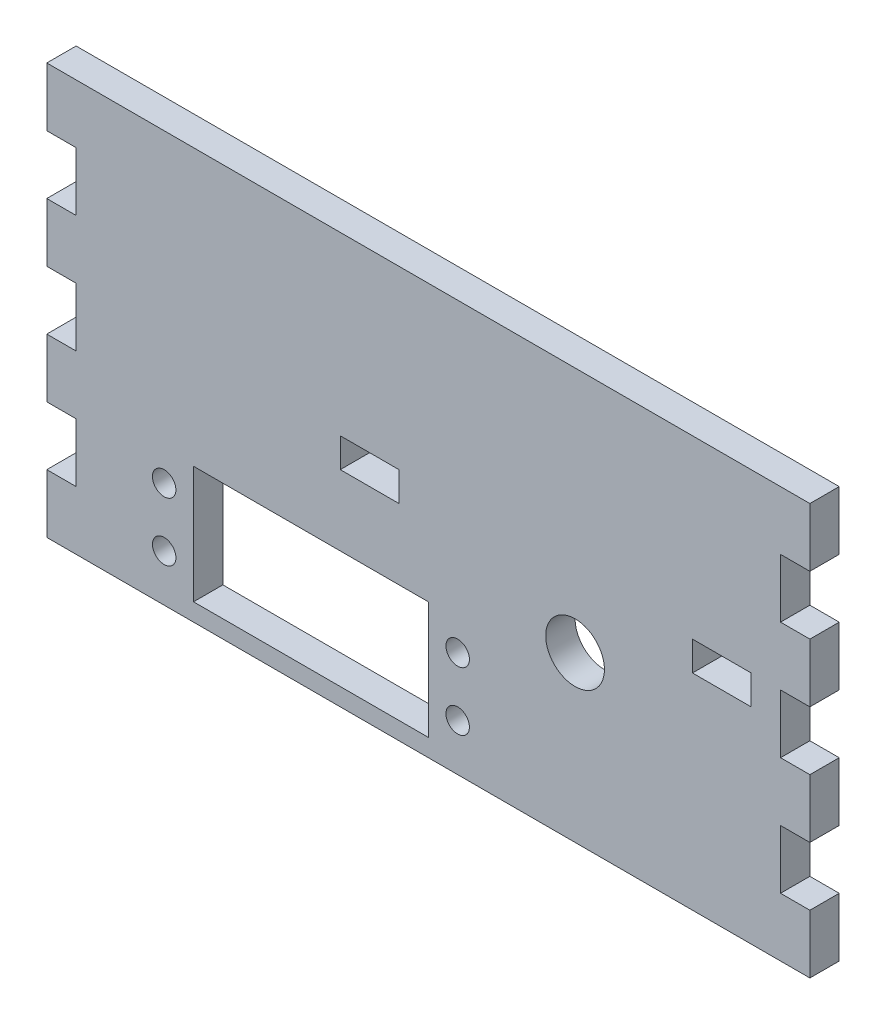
ISO-10303-21;
HEADER;
FILE_DESCRIPTION(('STEP AP214'),'2;1');
FILE_NAME('part.step','',(''),(''),'','','');
FILE_SCHEMA(('AUTOMOTIVE_DESIGN { 1 0 10303 214 1 1 1 1 }'));
ENDSEC;
DATA;
#1=APPLICATION_CONTEXT('core data for automotive mechanical design processes');
#2=APPLICATION_PROTOCOL_DEFINITION('international standard','automotive_design',2000,#1);
#3=PRODUCT_CONTEXT('',#1,'mechanical');
#4=PRODUCT('Part','Part','',(#3));
#5=PRODUCT_RELATED_PRODUCT_CATEGORY('part','',(#4));
#6=PRODUCT_DEFINITION_FORMATION('','',#4);
#7=PRODUCT_DEFINITION_CONTEXT('part definition',#1,'design');
#8=PRODUCT_DEFINITION('design','',#6,#7);
#9=PRODUCT_DEFINITION_SHAPE('','',#8);
#10=(LENGTH_UNIT() NAMED_UNIT(*) SI_UNIT(.MILLI.,.METRE.));
#11=(NAMED_UNIT(*) PLANE_ANGLE_UNIT() SI_UNIT($,.RADIAN.));
#12=(NAMED_UNIT(*) SI_UNIT($,.STERADIAN.) SOLID_ANGLE_UNIT());
#13=UNCERTAINTY_MEASURE_WITH_UNIT(LENGTH_MEASURE(1.E-05),#10,'distance_accuracy_value','');
#14=(GEOMETRIC_REPRESENTATION_CONTEXT(3) GLOBAL_UNCERTAINTY_ASSIGNED_CONTEXT((#13)) GLOBAL_UNIT_ASSIGNED_CONTEXT((#10,
#11,#12)) REPRESENTATION_CONTEXT('',''));
#15=CARTESIAN_POINT('',(0.,0.,0.));
#16=DIRECTION('',(0.,0.,1.));
#17=DIRECTION('',(1.,0.,0.));
#18=AXIS2_PLACEMENT_3D('',#15,#16,#17);
#19=CARTESIAN_POINT('',(-45.,35.,5.));
#20=DIRECTION('',(1.,0.,0.));
#21=DIRECTION('',(0.,1.,0.));
#22=AXIS2_PLACEMENT_3D('',#19,#20,#21);
#23=PLANE('',#22);
#24=DIRECTION('',(0.,0.,-1.));
#25=VECTOR('',#24,1.);
#26=CARTESIAN_POINT('',(-45.,-25.,0.));
#27=LINE('',#26,#25);
#28=CARTESIAN_POINT('',(-45.,-25.,5.));
#29=VERTEX_POINT('',#28);
#30=CARTESIAN_POINT('',(-45.,-25.,0.));
#31=VERTEX_POINT('',#30);
#32=EDGE_CURVE('E315',#29,#31,#27,.T.);
#33=ORIENTED_EDGE('',*,*,#32,.F.);
#34=DIRECTION('',(0.,-1.,0.));
#35=VECTOR('',#34,1.);
#36=CARTESIAN_POINT('',(-45.,35.,5.));
#37=LINE('',#36,#35);
#38=CARTESIAN_POINT('',(-45.,-15.,5.));
#39=VERTEX_POINT('',#38);
#40=EDGE_CURVE('E50',#39,#29,#37,.T.);
#41=ORIENTED_EDGE('',*,*,#40,.F.);
#42=DIRECTION('',(0.,0.,1.));
#43=VECTOR('',#42,1.);
#44=CARTESIAN_POINT('',(-45.,-15.,5.));
#45=LINE('',#44,#43);
#46=CARTESIAN_POINT('',(-45.,-15.,0.));
#47=VERTEX_POINT('',#46);
#48=EDGE_CURVE('E321',#47,#39,#45,.T.);
#49=ORIENTED_EDGE('',*,*,#48,.F.);
#50=DIRECTION('',(0.,-1.,0.));
#51=VECTOR('',#50,1.);
#52=CARTESIAN_POINT('',(-45.,35.,0.));
#53=LINE('',#52,#51);
#54=EDGE_CURVE('E412',#47,#31,#53,.T.);
#55=ORIENTED_EDGE('',*,*,#54,.T.);
#56=EDGE_LOOP('',(#33,#41,#49,#55));
#57=FACE_BOUND('',#56,.T.);
#58=ADVANCED_FACE('F33',(#57),#23,.F.);
#59=DIRECTION('',(0.,0.,-1.));
#60=VECTOR('',#59,1.);
#61=CARTESIAN_POINT('',(-45.,-5.00000000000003,0.));
#62=LINE('',#61,#60);
#63=CARTESIAN_POINT('',(-45.,-5.00000000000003,5.));
#64=VERTEX_POINT('',#63);
#65=CARTESIAN_POINT('',(-45.,-5.00000000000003,0.));
#66=VERTEX_POINT('',#65);
#67=EDGE_CURVE('E58',#64,#66,#62,.T.);
#68=ORIENTED_EDGE('',*,*,#67,.F.);
#69=CARTESIAN_POINT('',(-45.,4.99999999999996,5.));
#70=VERTEX_POINT('',#69);
#71=EDGE_CURVE('E413',#70,#64,#37,.T.);
#72=ORIENTED_EDGE('',*,*,#71,.F.);
#73=DIRECTION('',(0.,0.,1.));
#74=VECTOR('',#73,1.);
#75=CARTESIAN_POINT('',(-45.,4.99999999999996,5.));
#76=LINE('',#75,#74);
#77=CARTESIAN_POINT('',(-45.,4.99999999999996,0.));
#78=VERTEX_POINT('',#77);
#79=EDGE_CURVE('E353',#78,#70,#76,.T.);
#80=ORIENTED_EDGE('',*,*,#79,.F.);
#81=EDGE_CURVE('E408',#78,#66,#53,.T.);
#82=ORIENTED_EDGE('',*,*,#81,.T.);
#83=EDGE_LOOP('',(#68,#72,#80,#82));
#84=FACE_BOUND('',#83,.T.);
#85=ADVANCED_FACE('F652',(#84),#23,.F.);
#86=DIRECTION('',(0.,0.,-1.));
#87=VECTOR('',#86,1.);
#88=CARTESIAN_POINT('',(-45.,15.,0.));
#89=LINE('',#88,#87);
#90=CARTESIAN_POINT('',(-45.,15.,5.));
#91=VERTEX_POINT('',#90);
#92=CARTESIAN_POINT('',(-45.,15.,0.));
#93=VERTEX_POINT('',#92);
#94=EDGE_CURVE('E348',#91,#93,#89,.T.);
#95=ORIENTED_EDGE('',*,*,#94,.F.);
#96=CARTESIAN_POINT('',(-45.,25.,5.));
#97=VERTEX_POINT('',#96);
#98=EDGE_CURVE('E395',#97,#91,#37,.T.);
#99=ORIENTED_EDGE('',*,*,#98,.F.);
#100=DIRECTION('',(0.,0.,1.));
#101=VECTOR('',#100,1.);
#102=CARTESIAN_POINT('',(-45.,25.,5.));
#103=LINE('',#102,#101);
#104=CARTESIAN_POINT('',(-45.,25.,0.));
#105=VERTEX_POINT('',#104);
#106=EDGE_CURVE('E375',#105,#97,#103,.T.);
#107=ORIENTED_EDGE('',*,*,#106,.F.);
#108=EDGE_CURVE('E411',#105,#93,#53,.T.);
#109=ORIENTED_EDGE('',*,*,#108,.T.);
#110=EDGE_LOOP('',(#95,#99,#107,#109));
#111=FACE_BOUND('',#110,.T.);
#112=ADVANCED_FACE('F35',(#111),#23,.F.);
#113=CARTESIAN_POINT('',(75.,35.,5.));
#114=DIRECTION('',(-1.,0.,0.));
#115=DIRECTION('',(0.,-1.,0.));
#116=AXIS2_PLACEMENT_3D('',#113,#114,#115);
#117=PLANE('',#116);
#118=DIRECTION('',(0.,0.,-1.));
#119=VECTOR('',#118,1.);
#120=CARTESIAN_POINT('',(75.,25.,5.));
#121=LINE('',#120,#119);
#122=CARTESIAN_POINT('',(75.,25.,5.));
#123=VERTEX_POINT('',#122);
#124=CARTESIAN_POINT('',(75.,25.,0.));
#125=VERTEX_POINT('',#124);
#126=EDGE_CURVE('E405',#123,#125,#121,.T.);
#127=ORIENTED_EDGE('',*,*,#126,.F.);
#128=DIRECTION('',(0.,1.,0.));
#129=VECTOR('',#128,1.);
#130=CARTESIAN_POINT('',(75.,35.,5.));
#131=LINE('',#130,#129);
#132=CARTESIAN_POINT('',(75.,15.,5.));
#133=VERTEX_POINT('',#132);
#134=EDGE_CURVE('E437',#133,#123,#131,.T.);
#135=ORIENTED_EDGE('',*,*,#134,.F.);
#136=DIRECTION('',(0.,0.,1.));
#137=VECTOR('',#136,1.);
#138=CARTESIAN_POINT('',(75.,15.,5.));
#139=LINE('',#138,#137);
#140=CARTESIAN_POINT('',(75.,15.,0.));
#141=VERTEX_POINT('',#140);
#142=EDGE_CURVE('E888',#141,#133,#139,.T.);
#143=ORIENTED_EDGE('',*,*,#142,.F.);
#144=DIRECTION('',(0.,1.,0.));
#145=VECTOR('',#144,1.);
#146=CARTESIAN_POINT('',(75.,35.,0.));
#147=LINE('',#146,#145);
#148=EDGE_CURVE('E452',#141,#125,#147,.T.);
#149=ORIENTED_EDGE('',*,*,#148,.T.);
#150=EDGE_LOOP('',(#127,#135,#143,#149));
#151=FACE_BOUND('',#150,.T.);
#152=ADVANCED_FACE('F657',(#151),#117,.F.);
#153=DIRECTION('',(0.,0.,-1.));
#154=VECTOR('',#153,1.);
#155=CARTESIAN_POINT('',(75.,5.,5.));
#156=LINE('',#155,#154);
#157=CARTESIAN_POINT('',(75.,5.,5.));
#158=VERTEX_POINT('',#157);
#159=CARTESIAN_POINT('',(75.,5.,0.));
#160=VERTEX_POINT('',#159);
#161=EDGE_CURVE('E891',#158,#160,#156,.T.);
#162=ORIENTED_EDGE('',*,*,#161,.F.);
#163=CARTESIAN_POINT('',(75.,-5.,5.));
#164=VERTEX_POINT('',#163);
#165=EDGE_CURVE('E446',#164,#158,#131,.T.);
#166=ORIENTED_EDGE('',*,*,#165,.F.);
#167=DIRECTION('',(0.,0.,1.));
#168=VECTOR('',#167,1.);
#169=CARTESIAN_POINT('',(75.,-5.,5.));
#170=LINE('',#169,#168);
#171=CARTESIAN_POINT('',(75.,-5.,0.));
#172=VERTEX_POINT('',#171);
#173=EDGE_CURVE('E502',#172,#164,#170,.T.);
#174=ORIENTED_EDGE('',*,*,#173,.F.);
#175=EDGE_CURVE('E450',#172,#160,#147,.T.);
#176=ORIENTED_EDGE('',*,*,#175,.T.);
#177=EDGE_LOOP('',(#162,#166,#174,#176));
#178=FACE_BOUND('',#177,.T.);
#179=ADVANCED_FACE('F662',(#178),#117,.F.);
#180=DIRECTION('',(0.,0.,-1.));
#181=VECTOR('',#180,1.);
#182=CARTESIAN_POINT('',(75.,-15.,5.));
#183=LINE('',#182,#181);
#184=CARTESIAN_POINT('',(75.,-15.,5.));
#185=VERTEX_POINT('',#184);
#186=CARTESIAN_POINT('',(75.,-15.,0.));
#187=VERTEX_POINT('',#186);
#188=EDGE_CURVE('E490',#185,#187,#183,.T.);
#189=ORIENTED_EDGE('',*,*,#188,.F.);
#190=CARTESIAN_POINT('',(75.,-25.,5.));
#191=VERTEX_POINT('',#190);
#192=EDGE_CURVE('E442',#191,#185,#131,.T.);
#193=ORIENTED_EDGE('',*,*,#192,.F.);
#194=DIRECTION('',(0.,0.,1.));
#195=VECTOR('',#194,1.);
#196=CARTESIAN_POINT('',(75.,-25.,5.));
#197=LINE('',#196,#195);
#198=CARTESIAN_POINT('',(75.,-25.,0.));
#199=VERTEX_POINT('',#198);
#200=EDGE_CURVE('E510',#199,#191,#197,.T.);
#201=ORIENTED_EDGE('',*,*,#200,.F.);
#202=EDGE_CURVE('E459',#199,#187,#147,.T.);
#203=ORIENTED_EDGE('',*,*,#202,.T.);
#204=EDGE_LOOP('',(#189,#193,#201,#203));
#205=FACE_BOUND('',#204,.T.);
#206=ADVANCED_FACE('F665',(#205),#117,.F.);
#207=CARTESIAN_POINT('',(0.,0.,5.));
#208=DIRECTION('',(0.,0.,1.));
#209=DIRECTION('',(1.,0.,0.));
#210=AXIS2_PLACEMENT_3D('',#207,#208,#209);
#211=PLANE('',#210);
#212=CARTESIAN_POINT('',(20.0000000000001,-17.,5.));
#213=DIRECTION('',(0.,0.,1.));
#214=DIRECTION('',(1.,0.,0.));
#215=AXIS2_PLACEMENT_3D('',#212,#213,#214);
#216=CIRCLE('',#215,2.);
#217=CARTESIAN_POINT('',(22.0000000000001,-17.,5.));
#218=VERTEX_POINT('',#217);
#219=EDGE_CURVE('E710',#218,#218,#216,.T.);
#220=ORIENTED_EDGE('',*,*,#219,.F.);
#221=EDGE_LOOP('',(#220));
#222=FACE_BOUND('',#221,.T.);
#223=CARTESIAN_POINT('',(20.0000000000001,-27.,5.));
#224=DIRECTION('',(0.,0.,1.));
#225=DIRECTION('',(1.,0.,0.));
#226=AXIS2_PLACEMENT_3D('',#223,#224,#225);
#227=CIRCLE('',#226,2.);
#228=CARTESIAN_POINT('',(22.0000000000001,-27.,5.));
#229=VERTEX_POINT('',#228);
#230=EDGE_CURVE('E707',#229,#229,#227,.T.);
#231=ORIENTED_EDGE('',*,*,#230,.F.);
#232=EDGE_LOOP('',(#231));
#233=FACE_BOUND('',#232,.T.);
#234=CARTESIAN_POINT('',(-29.9999999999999,-17.,5.));
#235=DIRECTION('',(0.,0.,1.));
#236=DIRECTION('',(1.,0.,0.));
#237=AXIS2_PLACEMENT_3D('',#234,#235,#236);
#238=CIRCLE('',#237,2.);
#239=CARTESIAN_POINT('',(-27.9999999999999,-17.,5.));
#240=VERTEX_POINT('',#239);
#241=EDGE_CURVE('E703',#240,#240,#238,.T.);
#242=ORIENTED_EDGE('',*,*,#241,.F.);
#243=EDGE_LOOP('',(#242));
#244=FACE_BOUND('',#243,.T.);
#245=CARTESIAN_POINT('',(-29.9999999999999,-27.,5.));
#246=DIRECTION('',(0.,0.,1.));
#247=DIRECTION('',(1.,0.,0.));
#248=AXIS2_PLACEMENT_3D('',#245,#246,#247);
#249=CIRCLE('',#248,2.);
#250=CARTESIAN_POINT('',(-27.9999999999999,-27.,5.));
#251=VERTEX_POINT('',#250);
#252=EDGE_CURVE('E696',#251,#251,#249,.T.);
#253=ORIENTED_EDGE('',*,*,#252,.F.);
#254=EDGE_LOOP('',(#253));
#255=FACE_BOUND('',#254,.T.);
#256=DIRECTION('',(0.,-1.,0.));
#257=VECTOR('',#256,1.);
#258=CARTESIAN_POINT('',(-25.,-12.,5.));
#259=LINE('',#258,#257);
#260=CARTESIAN_POINT('',(-25.,-12.,5.));
#261=VERTEX_POINT('',#260);
#262=CARTESIAN_POINT('',(-25.,-32.,5.));
#263=VERTEX_POINT('',#262);
#264=EDGE_CURVE('E523',#261,#263,#259,.T.);
#265=ORIENTED_EDGE('',*,*,#264,.F.);
#266=DIRECTION('',(-1.,0.,0.));
#267=VECTOR('',#266,1.);
#268=CARTESIAN_POINT('',(-25.,-12.,5.));
#269=LINE('',#268,#267);
#270=CARTESIAN_POINT('',(15.,-12.,5.));
#271=VERTEX_POINT('',#270);
#272=EDGE_CURVE('E546',#271,#261,#269,.T.);
#273=ORIENTED_EDGE('',*,*,#272,.F.);
#274=DIRECTION('',(0.,1.,0.));
#275=VECTOR('',#274,1.);
#276=CARTESIAN_POINT('',(15.,-12.,5.));
#277=LINE('',#276,#275);
#278=CARTESIAN_POINT('',(15.,-32.,5.));
#279=VERTEX_POINT('',#278);
#280=EDGE_CURVE('E541',#279,#271,#277,.T.);
#281=ORIENTED_EDGE('',*,*,#280,.F.);
#282=DIRECTION('',(1.,0.,0.));
#283=VECTOR('',#282,1.);
#284=CARTESIAN_POINT('',(-25.,-32.,5.));
#285=LINE('',#284,#283);
#286=EDGE_CURVE('E535',#263,#279,#285,.T.);
#287=ORIENTED_EDGE('',*,*,#286,.F.);
#288=EDGE_LOOP('',(#265,#273,#281,#287));
#289=FACE_BOUND('',#288,.T.);
#290=CARTESIAN_POINT('',(40.,-7.,5.));
#291=DIRECTION('',(0.,0.,1.));
#292=DIRECTION('',(1.,0.,0.));
#293=AXIS2_PLACEMENT_3D('',#290,#291,#292);
#294=CIRCLE('',#293,5.);
#295=CARTESIAN_POINT('',(45.,-7.,5.));
#296=VERTEX_POINT('',#295);
#297=EDGE_CURVE('E554',#296,#296,#294,.T.);
#298=ORIENTED_EDGE('',*,*,#297,.F.);
#299=EDGE_LOOP('',(#298));
#300=FACE_BOUND('',#299,.T.);
#301=DIRECTION('',(1.,0.,0.));
#302=VECTOR('',#301,1.);
#303=CARTESIAN_POINT('',(0.,0.,5.));
#304=LINE('',#303,#302);
#305=CARTESIAN_POINT('',(0.,0.,5.));
#306=VERTEX_POINT('',#305);
#307=CARTESIAN_POINT('',(10.,0.,5.));
#308=VERTEX_POINT('',#307);
#309=EDGE_CURVE('E599',#306,#308,#304,.T.);
#310=ORIENTED_EDGE('',*,*,#309,.F.);
#311=DIRECTION('',(0.,-1.,0.));
#312=VECTOR('',#311,1.);
#313=CARTESIAN_POINT('',(0.,0.,5.));
#314=LINE('',#313,#312);
#315=CARTESIAN_POINT('',(0.,5.,5.));
#316=VERTEX_POINT('',#315);
#317=EDGE_CURVE('E597',#316,#306,#314,.T.);
#318=ORIENTED_EDGE('',*,*,#317,.F.);
#319=DIRECTION('',(-1.,0.,0.));
#320=VECTOR('',#319,1.);
#321=CARTESIAN_POINT('',(0.,5.,5.));
#322=LINE('',#321,#320);
#323=CARTESIAN_POINT('',(10.,5.,5.));
#324=VERTEX_POINT('',#323);
#325=EDGE_CURVE('E605',#324,#316,#322,.T.);
#326=ORIENTED_EDGE('',*,*,#325,.F.);
#327=DIRECTION('',(0.,1.,0.));
#328=VECTOR('',#327,1.);
#329=CARTESIAN_POINT('',(10.,0.,5.));
#330=LINE('',#329,#328);
#331=EDGE_CURVE('E602',#308,#324,#330,.T.);
#332=ORIENTED_EDGE('',*,*,#331,.F.);
#333=EDGE_LOOP('',(#310,#318,#326,#332));
#334=FACE_BOUND('',#333,.T.);
#335=DIRECTION('',(-1.,0.,0.));
#336=VECTOR('',#335,1.);
#337=CARTESIAN_POINT('',(-45.,35.,5.));
#338=LINE('',#337,#336);
#339=CARTESIAN_POINT('',(80.,35.,5.));
#340=VERTEX_POINT('',#339);
#341=CARTESIAN_POINT('',(-50.,35.,5.));
#342=VERTEX_POINT('',#341);
#343=EDGE_CURVE('E418',#340,#342,#338,.T.);
#344=ORIENTED_EDGE('',*,*,#343,.T.);
#345=DIRECTION('',(0.,1.,0.));
#346=VECTOR('',#345,1.);
#347=CARTESIAN_POINT('',(-50.,35.,5.));
#348=LINE('',#347,#346);
#349=CARTESIAN_POINT('',(-50.,25.,5.));
#350=VERTEX_POINT('',#349);
#351=EDGE_CURVE('E376',#350,#342,#348,.T.);
#352=ORIENTED_EDGE('',*,*,#351,.F.);
#353=DIRECTION('',(1.,0.,0.));
#354=VECTOR('',#353,1.);
#355=CARTESIAN_POINT('',(-50.,25.,5.));
#356=LINE('',#355,#354);
#357=EDGE_CURVE('E386',#350,#97,#356,.T.);
#358=ORIENTED_EDGE('',*,*,#357,.T.);
#359=ORIENTED_EDGE('',*,*,#98,.T.);
#360=DIRECTION('',(1.,0.,0.));
#361=VECTOR('',#360,1.);
#362=CARTESIAN_POINT('',(-50.,15.,5.));
#363=LINE('',#362,#361);
#364=CARTESIAN_POINT('',(-50.,15.,5.));
#365=VERTEX_POINT('',#364);
#366=EDGE_CURVE('E372',#365,#91,#363,.T.);
#367=ORIENTED_EDGE('',*,*,#366,.F.);
#368=DIRECTION('',(0.,1.,0.));
#369=VECTOR('',#368,1.);
#370=CARTESIAN_POINT('',(-50.,15.,5.));
#371=LINE('',#370,#369);
#372=CARTESIAN_POINT('',(-50.,4.99999999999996,5.));
#373=VERTEX_POINT('',#372);
#374=EDGE_CURVE('E349',#373,#365,#371,.T.);
#375=ORIENTED_EDGE('',*,*,#374,.F.);
#376=DIRECTION('',(1.,0.,0.));
#377=VECTOR('',#376,1.);
#378=CARTESIAN_POINT('',(-50.,4.99999999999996,5.));
#379=LINE('',#378,#377);
#380=EDGE_CURVE('E359',#373,#70,#379,.T.);
#381=ORIENTED_EDGE('',*,*,#380,.T.);
#382=ORIENTED_EDGE('',*,*,#71,.T.);
#383=DIRECTION('',(1.,0.,0.));
#384=VECTOR('',#383,1.);
#385=CARTESIAN_POINT('',(-50.,-5.00000000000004,5.));
#386=LINE('',#385,#384);
#387=CARTESIAN_POINT('',(-50.,-5.00000000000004,5.));
#388=VERTEX_POINT('',#387);
#389=EDGE_CURVE('E345',#388,#64,#386,.T.);
#390=ORIENTED_EDGE('',*,*,#389,.F.);
#391=DIRECTION('',(0.,1.,0.));
#392=VECTOR('',#391,1.);
#393=CARTESIAN_POINT('',(-50.,-5.00000000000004,5.));
#394=LINE('',#393,#392);
#395=CARTESIAN_POINT('',(-50.,-15.,5.));
#396=VERTEX_POINT('',#395);
#397=EDGE_CURVE('E326',#396,#388,#394,.T.);
#398=ORIENTED_EDGE('',*,*,#397,.F.);
#399=DIRECTION('',(1.,0.,0.));
#400=VECTOR('',#399,1.);
#401=CARTESIAN_POINT('',(-50.,-15.,5.));
#402=LINE('',#401,#400);
#403=EDGE_CURVE('E334',#396,#39,#402,.T.);
#404=ORIENTED_EDGE('',*,*,#403,.T.);
#405=ORIENTED_EDGE('',*,*,#40,.T.);
#406=DIRECTION('',(1.,0.,0.));
#407=VECTOR('',#406,1.);
#408=CARTESIAN_POINT('',(-50.,-25.,5.));
#409=LINE('',#408,#407);
#410=CARTESIAN_POINT('',(-50.,-25.,5.));
#411=VERTEX_POINT('',#410);
#412=EDGE_CURVE('E319',#411,#29,#409,.T.);
#413=ORIENTED_EDGE('',*,*,#412,.F.);
#414=DIRECTION('',(0.,1.,0.));
#415=VECTOR('',#414,1.);
#416=CARTESIAN_POINT('',(-50.,-25.,5.));
#417=LINE('',#416,#415);
#418=CARTESIAN_POINT('',(-50.,-35.,5.));
#419=VERTEX_POINT('',#418);
#420=EDGE_CURVE('E312',#419,#411,#417,.T.);
#421=ORIENTED_EDGE('',*,*,#420,.F.);
#422=DIRECTION('',(1.,0.,0.));
#423=VECTOR('',#422,1.);
#424=CARTESIAN_POINT('',(-45.,-35.,5.));
#425=LINE('',#424,#423);
#426=CARTESIAN_POINT('',(80.,-35.,5.));
#427=VERTEX_POINT('',#426);
#428=EDGE_CURVE('E434',#419,#427,#425,.T.);
#429=ORIENTED_EDGE('',*,*,#428,.T.);
#430=DIRECTION('',(0.,-1.,0.));
#431=VECTOR('',#430,1.);
#432=CARTESIAN_POINT('',(80.,-35.,5.));
#433=LINE('',#432,#431);
#434=CARTESIAN_POINT('',(80.,-25.,5.));
#435=VERTEX_POINT('',#434);
#436=EDGE_CURVE('E511',#435,#427,#433,.T.);
#437=ORIENTED_EDGE('',*,*,#436,.F.);
#438=DIRECTION('',(-1.,0.,0.));
#439=VECTOR('',#438,1.);
#440=CARTESIAN_POINT('',(80.,-25.,5.));
#441=LINE('',#440,#439);
#442=EDGE_CURVE('E483',#435,#191,#441,.T.);
#443=ORIENTED_EDGE('',*,*,#442,.T.);
#444=ORIENTED_EDGE('',*,*,#192,.T.);
#445=DIRECTION('',(-1.,0.,0.));
#446=VECTOR('',#445,1.);
#447=CARTESIAN_POINT('',(80.,-15.,5.));
#448=LINE('',#447,#446);
#449=CARTESIAN_POINT('',(80.,-15.,5.));
#450=VERTEX_POINT('',#449);
#451=EDGE_CURVE('E479',#450,#185,#448,.T.);
#452=ORIENTED_EDGE('',*,*,#451,.F.);
#453=DIRECTION('',(0.,-1.,0.));
#454=VECTOR('',#453,1.);
#455=CARTESIAN_POINT('',(80.,-15.,5.));
#456=LINE('',#455,#454);
#457=CARTESIAN_POINT('',(80.,-5.,5.));
#458=VERTEX_POINT('',#457);
#459=EDGE_CURVE('E494',#458,#450,#456,.T.);
#460=ORIENTED_EDGE('',*,*,#459,.F.);
#461=DIRECTION('',(-1.,0.,0.));
#462=VECTOR('',#461,1.);
#463=CARTESIAN_POINT('',(80.,-5.,5.));
#464=LINE('',#463,#462);
#465=EDGE_CURVE('E493',#458,#164,#464,.T.);
#466=ORIENTED_EDGE('',*,*,#465,.T.);
#467=ORIENTED_EDGE('',*,*,#165,.T.);
#468=DIRECTION('',(-1.,0.,0.));
#469=VECTOR('',#468,1.);
#470=CARTESIAN_POINT('',(80.,5.,5.));
#471=LINE('',#470,#469);
#472=CARTESIAN_POINT('',(80.,5.,5.));
#473=VERTEX_POINT('',#472);
#474=EDGE_CURVE('E882',#473,#158,#471,.T.);
#475=ORIENTED_EDGE('',*,*,#474,.F.);
#476=DIRECTION('',(0.,-1.,0.));
#477=VECTOR('',#476,1.);
#478=CARTESIAN_POINT('',(80.,5.,5.));
#479=LINE('',#478,#477);
#480=CARTESIAN_POINT('',(80.,15.,5.));
#481=VERTEX_POINT('',#480);
#482=EDGE_CURVE('E887',#481,#473,#479,.T.);
#483=ORIENTED_EDGE('',*,*,#482,.F.);
#484=DIRECTION('',(-1.,0.,0.));
#485=VECTOR('',#484,1.);
#486=CARTESIAN_POINT('',(80.,15.,5.));
#487=LINE('',#486,#485);
#488=EDGE_CURVE('E877',#481,#133,#487,.T.);
#489=ORIENTED_EDGE('',*,*,#488,.T.);
#490=ORIENTED_EDGE('',*,*,#134,.T.);
#491=DIRECTION('',(-1.,0.,0.));
#492=VECTOR('',#491,1.);
#493=CARTESIAN_POINT('',(80.,25.,5.));
#494=LINE('',#493,#492);
#495=CARTESIAN_POINT('',(80.,25.,5.));
#496=VERTEX_POINT('',#495);
#497=EDGE_CURVE('E902',#496,#123,#494,.T.);
#498=ORIENTED_EDGE('',*,*,#497,.F.);
#499=DIRECTION('',(0.,-1.,0.));
#500=VECTOR('',#499,1.);
#501=CARTESIAN_POINT('',(80.,25.,5.));
#502=LINE('',#501,#500);
#503=EDGE_CURVE('E904',#340,#496,#502,.T.);
#504=ORIENTED_EDGE('',*,*,#503,.F.);
#505=EDGE_LOOP('',(#344,#352,#358,#359,#367,#375,#381,#382,#390,#398,#404,#405,#413,#421,#429,
#437,#443,#444,#452,#460,#466,#467,#475,#483,#489,#490,#498,#504));
#506=FACE_BOUND('',#505,.T.);
#507=DIRECTION('',(1.,0.,0.));
#508=VECTOR('',#507,1.);
#509=CARTESIAN_POINT('',(60.,0.,5.));
#510=LINE('',#509,#508);
#511=CARTESIAN_POINT('',(60.,0.,5.));
#512=VERTEX_POINT('',#511);
#513=CARTESIAN_POINT('',(70.,0.,5.));
#514=VERTEX_POINT('',#513);
#515=EDGE_CURVE('E568',#512,#514,#510,.T.);
#516=ORIENTED_EDGE('',*,*,#515,.F.);
#517=DIRECTION('',(0.,-1.,0.));
#518=VECTOR('',#517,1.);
#519=CARTESIAN_POINT('',(60.,5.,5.));
#520=LINE('',#519,#518);
#521=CARTESIAN_POINT('',(60.,5.,5.));
#522=VERTEX_POINT('',#521);
#523=EDGE_CURVE('E566',#522,#512,#520,.T.);
#524=ORIENTED_EDGE('',*,*,#523,.F.);
#525=DIRECTION('',(-1.,0.,0.));
#526=VECTOR('',#525,1.);
#527=CARTESIAN_POINT('',(60.,5.,5.));
#528=LINE('',#527,#526);
#529=CARTESIAN_POINT('',(70.,5.,5.));
#530=VERTEX_POINT('',#529);
#531=EDGE_CURVE('E574',#530,#522,#528,.T.);
#532=ORIENTED_EDGE('',*,*,#531,.F.);
#533=DIRECTION('',(0.,1.,0.));
#534=VECTOR('',#533,1.);
#535=CARTESIAN_POINT('',(70.,5.,5.));
#536=LINE('',#535,#534);
#537=EDGE_CURVE('E571',#514,#530,#536,.T.);
#538=ORIENTED_EDGE('',*,*,#537,.F.);
#539=EDGE_LOOP('',(#516,#524,#532,#538));
#540=FACE_BOUND('',#539,.T.);
#541=ADVANCED_FACE('F476',(#222,#233,#244,#255,#289,#300,#334,#506,#540),#211,.T.);
#542=CARTESIAN_POINT('',(0.,0.,0.));
#543=DIRECTION('',(0.,0.,1.));
#544=DIRECTION('',(1.,0.,0.));
#545=AXIS2_PLACEMENT_3D('',#542,#543,#544);
#546=PLANE('',#545);
#547=CARTESIAN_POINT('',(20.0000000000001,-17.,0.));
#548=DIRECTION('',(0.,0.,1.));
#549=DIRECTION('',(1.,0.,0.));
#550=AXIS2_PLACEMENT_3D('',#547,#548,#549);
#551=CIRCLE('',#550,2.);
#552=CARTESIAN_POINT('',(22.0000000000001,-17.,0.));
#553=VERTEX_POINT('',#552);
#554=EDGE_CURVE('E37',#553,#553,#551,.T.);
#555=ORIENTED_EDGE('',*,*,#554,.T.);
#556=EDGE_LOOP('',(#555));
#557=FACE_BOUND('',#556,.T.);
#558=CARTESIAN_POINT('',(20.0000000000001,-27.,0.));
#559=DIRECTION('',(0.,0.,1.));
#560=DIRECTION('',(1.,0.,0.));
#561=AXIS2_PLACEMENT_3D('',#558,#559,#560);
#562=CIRCLE('',#561,2.);
#563=CARTESIAN_POINT('',(22.0000000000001,-27.,0.));
#564=VERTEX_POINT('',#563);
#565=EDGE_CURVE('E706',#564,#564,#562,.T.);
#566=ORIENTED_EDGE('',*,*,#565,.T.);
#567=EDGE_LOOP('',(#566));
#568=FACE_BOUND('',#567,.T.);
#569=CARTESIAN_POINT('',(-29.9999999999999,-17.,0.));
#570=DIRECTION('',(0.,0.,1.));
#571=DIRECTION('',(1.,0.,0.));
#572=AXIS2_PLACEMENT_3D('',#569,#570,#571);
#573=CIRCLE('',#572,2.);
#574=CARTESIAN_POINT('',(-27.9999999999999,-17.,0.));
#575=VERTEX_POINT('',#574);
#576=EDGE_CURVE('E702',#575,#575,#573,.T.);
#577=ORIENTED_EDGE('',*,*,#576,.T.);
#578=EDGE_LOOP('',(#577));
#579=FACE_BOUND('',#578,.T.);
#580=CARTESIAN_POINT('',(-29.9999999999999,-27.,0.));
#581=DIRECTION('',(0.,0.,1.));
#582=DIRECTION('',(1.,0.,0.));
#583=AXIS2_PLACEMENT_3D('',#580,#581,#582);
#584=CIRCLE('',#583,2.);
#585=CARTESIAN_POINT('',(-27.9999999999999,-27.,0.));
#586=VERTEX_POINT('',#585);
#587=EDGE_CURVE('E428',#586,#586,#584,.T.);
#588=ORIENTED_EDGE('',*,*,#587,.T.);
#589=EDGE_LOOP('',(#588));
#590=FACE_BOUND('',#589,.T.);
#591=DIRECTION('',(-1.,0.,0.));
#592=VECTOR('',#591,1.);
#593=CARTESIAN_POINT('',(0.,-12.,0.));
#594=LINE('',#593,#592);
#595=CARTESIAN_POINT('',(15.,-12.,0.));
#596=VERTEX_POINT('',#595);
#597=CARTESIAN_POINT('',(-25.,-12.,0.));
#598=VERTEX_POINT('',#597);
#599=EDGE_CURVE('E42',#596,#598,#594,.T.);
#600=ORIENTED_EDGE('',*,*,#599,.T.);
#601=DIRECTION('',(0.,-1.,0.));
#602=VECTOR('',#601,1.);
#603=CARTESIAN_POINT('',(-25.,0.,0.));
#604=LINE('',#603,#602);
#605=CARTESIAN_POINT('',(-25.,-32.,0.));
#606=VERTEX_POINT('',#605);
#607=EDGE_CURVE('E11',#598,#606,#604,.T.);
#608=ORIENTED_EDGE('',*,*,#607,.T.);
#609=DIRECTION('',(1.,0.,0.));
#610=VECTOR('',#609,1.);
#611=CARTESIAN_POINT('',(0.,-32.,0.));
#612=LINE('',#611,#610);
#613=CARTESIAN_POINT('',(15.,-32.,0.));
#614=VERTEX_POINT('',#613);
#615=EDGE_CURVE('E465',#606,#614,#612,.T.);
#616=ORIENTED_EDGE('',*,*,#615,.T.);
#617=DIRECTION('',(0.,1.,0.));
#618=VECTOR('',#617,1.);
#619=CARTESIAN_POINT('',(15.,0.,0.));
#620=LINE('',#619,#618);
#621=EDGE_CURVE('E463',#614,#596,#620,.T.);
#622=ORIENTED_EDGE('',*,*,#621,.T.);
#623=EDGE_LOOP('',(#600,#608,#616,#622));
#624=FACE_BOUND('',#623,.T.);
#625=CARTESIAN_POINT('',(40.,-7.,0.));
#626=DIRECTION('',(0.,0.,1.));
#627=DIRECTION('',(1.,0.,0.));
#628=AXIS2_PLACEMENT_3D('',#625,#626,#627);
#629=CIRCLE('',#628,5.);
#630=CARTESIAN_POINT('',(45.,-7.,0.));
#631=VERTEX_POINT('',#630);
#632=EDGE_CURVE('E560',#631,#631,#629,.T.);
#633=ORIENTED_EDGE('',*,*,#632,.T.);
#634=EDGE_LOOP('',(#633));
#635=FACE_BOUND('',#634,.T.);
#636=DIRECTION('',(0.,-1.,0.));
#637=VECTOR('',#636,1.);
#638=CARTESIAN_POINT('',(0.,0.,0.));
#639=LINE('',#638,#637);
#640=CARTESIAN_POINT('',(0.,5.,0.));
#641=VERTEX_POINT('',#640);
#642=CARTESIAN_POINT('',(0.,0.,0.));
#643=VERTEX_POINT('',#642);
#644=EDGE_CURVE('E596',#641,#643,#639,.T.);
#645=ORIENTED_EDGE('',*,*,#644,.T.);
#646=DIRECTION('',(1.,0.,0.));
#647=VECTOR('',#646,1.);
#648=CARTESIAN_POINT('',(0.,0.,0.));
#649=LINE('',#648,#647);
#650=CARTESIAN_POINT('',(10.,0.,0.));
#651=VERTEX_POINT('',#650);
#652=EDGE_CURVE('E610',#643,#651,#649,.T.);
#653=ORIENTED_EDGE('',*,*,#652,.T.);
#654=DIRECTION('',(0.,1.,0.));
#655=VECTOR('',#654,1.);
#656=CARTESIAN_POINT('',(10.,0.,0.));
#657=LINE('',#656,#655);
#658=CARTESIAN_POINT('',(10.,5.,0.));
#659=VERTEX_POINT('',#658);
#660=EDGE_CURVE('E613',#651,#659,#657,.T.);
#661=ORIENTED_EDGE('',*,*,#660,.T.);
#662=DIRECTION('',(-1.,0.,0.));
#663=VECTOR('',#662,1.);
#664=CARTESIAN_POINT('',(0.,5.,0.));
#665=LINE('',#664,#663);
#666=EDGE_CURVE('E600',#659,#641,#665,.T.);
#667=ORIENTED_EDGE('',*,*,#666,.T.);
#668=EDGE_LOOP('',(#645,#653,#661,#667));
#669=FACE_BOUND('',#668,.T.);
#670=ORIENTED_EDGE('',*,*,#108,.F.);
#671=DIRECTION('',(1.,0.,0.));
#672=VECTOR('',#671,1.);
#673=CARTESIAN_POINT('',(-50.,25.,0.));
#674=LINE('',#673,#672);
#675=CARTESIAN_POINT('',(-50.,25.,0.));
#676=VERTEX_POINT('',#675);
#677=EDGE_CURVE('E400',#676,#105,#674,.T.);
#678=ORIENTED_EDGE('',*,*,#677,.F.);
#679=DIRECTION('',(0.,-1.,0.));
#680=VECTOR('',#679,1.);
#681=CARTESIAN_POINT('',(-50.,25.,0.));
#682=LINE('',#681,#680);
#683=CARTESIAN_POINT('',(-50.,35.,0.));
#684=VERTEX_POINT('',#683);
#685=EDGE_CURVE('E382',#684,#676,#682,.T.);
#686=ORIENTED_EDGE('',*,*,#685,.F.);
#687=DIRECTION('',(-1.,0.,0.));
#688=VECTOR('',#687,1.);
#689=CARTESIAN_POINT('',(-45.,35.,0.));
#690=LINE('',#689,#688);
#691=CARTESIAN_POINT('',(80.,35.,0.));
#692=VERTEX_POINT('',#691);
#693=EDGE_CURVE('E427',#692,#684,#690,.T.);
#694=ORIENTED_EDGE('',*,*,#693,.F.);
#695=DIRECTION('',(0.,1.,0.));
#696=VECTOR('',#695,1.);
#697=CARTESIAN_POINT('',(80.,25.,0.));
#698=LINE('',#697,#696);
#699=CARTESIAN_POINT('',(80.,25.,0.));
#700=VERTEX_POINT('',#699);
#701=EDGE_CURVE('E910',#700,#692,#698,.T.);
#702=ORIENTED_EDGE('',*,*,#701,.F.);
#703=DIRECTION('',(-1.,0.,0.));
#704=VECTOR('',#703,1.);
#705=CARTESIAN_POINT('',(80.,25.,0.));
#706=LINE('',#705,#704);
#707=EDGE_CURVE('E893',#700,#125,#706,.T.);
#708=ORIENTED_EDGE('',*,*,#707,.T.);
#709=ORIENTED_EDGE('',*,*,#148,.F.);
#710=DIRECTION('',(-1.,0.,0.));
#711=VECTOR('',#710,1.);
#712=CARTESIAN_POINT('',(80.,15.,0.));
#713=LINE('',#712,#711);
#714=CARTESIAN_POINT('',(80.,15.,0.));
#715=VERTEX_POINT('',#714);
#716=EDGE_CURVE('E873',#715,#141,#713,.T.);
#717=ORIENTED_EDGE('',*,*,#716,.F.);
#718=DIRECTION('',(0.,1.,0.));
#719=VECTOR('',#718,1.);
#720=CARTESIAN_POINT('',(80.,5.,0.));
#721=LINE('',#720,#719);
#722=CARTESIAN_POINT('',(80.,5.,0.));
#723=VERTEX_POINT('',#722);
#724=EDGE_CURVE('E897',#723,#715,#721,.T.);
#725=ORIENTED_EDGE('',*,*,#724,.F.);
#726=DIRECTION('',(-1.,0.,0.));
#727=VECTOR('',#726,1.);
#728=CARTESIAN_POINT('',(80.,5.,0.));
#729=LINE('',#728,#727);
#730=EDGE_CURVE('E869',#723,#160,#729,.T.);
#731=ORIENTED_EDGE('',*,*,#730,.T.);
#732=ORIENTED_EDGE('',*,*,#175,.F.);
#733=DIRECTION('',(-1.,0.,0.));
#734=VECTOR('',#733,1.);
#735=CARTESIAN_POINT('',(80.,-5.,0.));
#736=LINE('',#735,#734);
#737=CARTESIAN_POINT('',(80.,-5.,0.));
#738=VERTEX_POINT('',#737);
#739=EDGE_CURVE('E497',#738,#172,#736,.T.);
#740=ORIENTED_EDGE('',*,*,#739,.F.);
#741=DIRECTION('',(0.,1.,0.));
#742=VECTOR('',#741,1.);
#743=CARTESIAN_POINT('',(80.,-15.,0.));
#744=LINE('',#743,#742);
#745=CARTESIAN_POINT('',(80.,-15.,0.));
#746=VERTEX_POINT('',#745);
#747=EDGE_CURVE('E863',#746,#738,#744,.T.);
#748=ORIENTED_EDGE('',*,*,#747,.F.);
#749=DIRECTION('',(-1.,0.,0.));
#750=VECTOR('',#749,1.);
#751=CARTESIAN_POINT('',(80.,-15.,0.));
#752=LINE('',#751,#750);
#753=EDGE_CURVE('E507',#746,#187,#752,.T.);
#754=ORIENTED_EDGE('',*,*,#753,.T.);
#755=ORIENTED_EDGE('',*,*,#202,.F.);
#756=DIRECTION('',(-1.,0.,0.));
#757=VECTOR('',#756,1.);
#758=CARTESIAN_POINT('',(80.,-25.,0.));
#759=LINE('',#758,#757);
#760=CARTESIAN_POINT('',(80.,-25.,0.));
#761=VERTEX_POINT('',#760);
#762=EDGE_CURVE('E527',#761,#199,#759,.T.);
#763=ORIENTED_EDGE('',*,*,#762,.F.);
#764=DIRECTION('',(0.,1.,0.));
#765=VECTOR('',#764,1.);
#766=CARTESIAN_POINT('',(80.,-35.,0.));
#767=LINE('',#766,#765);
#768=CARTESIAN_POINT('',(80.,-35.,0.));
#769=VERTEX_POINT('',#768);
#770=EDGE_CURVE('E517',#769,#761,#767,.T.);
#771=ORIENTED_EDGE('',*,*,#770,.F.);
#772=DIRECTION('',(1.,0.,0.));
#773=VECTOR('',#772,1.);
#774=CARTESIAN_POINT('',(-45.,-35.,0.));
#775=LINE('',#774,#773);
#776=CARTESIAN_POINT('',(-50.,-35.,0.));
#777=VERTEX_POINT('',#776);
#778=EDGE_CURVE('E302',#777,#769,#775,.T.);
#779=ORIENTED_EDGE('',*,*,#778,.F.);
#780=DIRECTION('',(0.,-1.,0.));
#781=VECTOR('',#780,1.);
#782=CARTESIAN_POINT('',(-50.,-35.,0.));
#783=LINE('',#782,#781);
#784=CARTESIAN_POINT('',(-50.,-25.,0.));
#785=VERTEX_POINT('',#784);
#786=EDGE_CURVE('E293',#785,#777,#783,.T.);
#787=ORIENTED_EDGE('',*,*,#786,.F.);
#788=DIRECTION('',(1.,0.,0.));
#789=VECTOR('',#788,1.);
#790=CARTESIAN_POINT('',(-50.,-25.,0.));
#791=LINE('',#790,#789);
#792=EDGE_CURVE('E299',#785,#31,#791,.T.);
#793=ORIENTED_EDGE('',*,*,#792,.T.);
#794=ORIENTED_EDGE('',*,*,#54,.F.);
#795=DIRECTION('',(1.,0.,0.));
#796=VECTOR('',#795,1.);
#797=CARTESIAN_POINT('',(-50.,-15.,0.));
#798=LINE('',#797,#796);
#799=CARTESIAN_POINT('',(-50.,-15.,0.));
#800=VERTEX_POINT('',#799);
#801=EDGE_CURVE('E339',#800,#47,#798,.T.);
#802=ORIENTED_EDGE('',*,*,#801,.F.);
#803=DIRECTION('',(0.,-1.,0.));
#804=VECTOR('',#803,1.);
#805=CARTESIAN_POINT('',(-50.,-15.,0.));
#806=LINE('',#805,#804);
#807=CARTESIAN_POINT('',(-50.,-5.00000000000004,0.));
#808=VERTEX_POINT('',#807);
#809=EDGE_CURVE('E331',#808,#800,#806,.T.);
#810=ORIENTED_EDGE('',*,*,#809,.F.);
#811=DIRECTION('',(1.,0.,0.));
#812=VECTOR('',#811,1.);
#813=CARTESIAN_POINT('',(-50.,-5.00000000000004,0.));
#814=LINE('',#813,#812);
#815=EDGE_CURVE('E342',#808,#66,#814,.T.);
#816=ORIENTED_EDGE('',*,*,#815,.T.);
#817=ORIENTED_EDGE('',*,*,#81,.F.);
#818=DIRECTION('',(1.,0.,0.));
#819=VECTOR('',#818,1.);
#820=CARTESIAN_POINT('',(-50.,4.99999999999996,0.));
#821=LINE('',#820,#819);
#822=CARTESIAN_POINT('',(-50.,4.99999999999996,0.));
#823=VERTEX_POINT('',#822);
#824=EDGE_CURVE('E366',#823,#78,#821,.T.);
#825=ORIENTED_EDGE('',*,*,#824,.F.);
#826=DIRECTION('',(0.,-1.,0.));
#827=VECTOR('',#826,1.);
#828=CARTESIAN_POINT('',(-50.,4.99999999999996,0.));
#829=LINE('',#828,#827);
#830=CARTESIAN_POINT('',(-50.,15.,0.));
#831=VERTEX_POINT('',#830);
#832=EDGE_CURVE('E355',#831,#823,#829,.T.);
#833=ORIENTED_EDGE('',*,*,#832,.F.);
#834=DIRECTION('',(1.,0.,0.));
#835=VECTOR('',#834,1.);
#836=CARTESIAN_POINT('',(-50.,15.,0.));
#837=LINE('',#836,#835);
#838=EDGE_CURVE('E369',#831,#93,#837,.T.);
#839=ORIENTED_EDGE('',*,*,#838,.T.);
#840=EDGE_LOOP('',(#670,#678,#686,#694,#702,#708,#709,#717,#725,#731,#732,#740,#748,#754,#755,
#763,#771,#779,#787,#793,#794,#802,#810,#816,#817,#825,#833,#839));
#841=FACE_BOUND('',#840,.T.);
#842=DIRECTION('',(0.,-1.,0.));
#843=VECTOR('',#842,1.);
#844=CARTESIAN_POINT('',(60.,5.,0.));
#845=LINE('',#844,#843);
#846=CARTESIAN_POINT('',(60.,5.,0.));
#847=VERTEX_POINT('',#846);
#848=CARTESIAN_POINT('',(60.,0.,0.));
#849=VERTEX_POINT('',#848);
#850=EDGE_CURVE('E563',#847,#849,#845,.T.);
#851=ORIENTED_EDGE('',*,*,#850,.T.);
#852=DIRECTION('',(1.,0.,0.));
#853=VECTOR('',#852,1.);
#854=CARTESIAN_POINT('',(60.,0.,0.));
#855=LINE('',#854,#853);
#856=CARTESIAN_POINT('',(70.,0.,0.));
#857=VERTEX_POINT('',#856);
#858=EDGE_CURVE('E579',#849,#857,#855,.T.);
#859=ORIENTED_EDGE('',*,*,#858,.T.);
#860=DIRECTION('',(0.,1.,0.));
#861=VECTOR('',#860,1.);
#862=CARTESIAN_POINT('',(70.,5.,0.));
#863=LINE('',#862,#861);
#864=CARTESIAN_POINT('',(70.,5.,0.));
#865=VERTEX_POINT('',#864);
#866=EDGE_CURVE('E582',#857,#865,#863,.T.);
#867=ORIENTED_EDGE('',*,*,#866,.T.);
#868=DIRECTION('',(-1.,0.,0.));
#869=VECTOR('',#868,1.);
#870=CARTESIAN_POINT('',(60.,5.,0.));
#871=LINE('',#870,#869);
#872=EDGE_CURVE('E569',#865,#847,#871,.T.);
#873=ORIENTED_EDGE('',*,*,#872,.T.);
#874=EDGE_LOOP('',(#851,#859,#867,#873));
#875=FACE_BOUND('',#874,.T.);
#876=ADVANCED_FACE('F296',(#557,#568,#579,#590,#624,#635,#669,#841,#875),#546,.F.);
#877=CARTESIAN_POINT('',(-45.,-35.,5.));
#878=DIRECTION('',(0.,1.,0.));
#879=DIRECTION('',(0.,0.,1.));
#880=AXIS2_PLACEMENT_3D('',#877,#878,#879);
#881=PLANE('',#880);
#882=ORIENTED_EDGE('',*,*,#778,.T.);
#883=DIRECTION('',(0.,0.,-1.));
#884=VECTOR('',#883,1.);
#885=CARTESIAN_POINT('',(80.,-35.,5.));
#886=LINE('',#885,#884);
#887=EDGE_CURVE('E514',#427,#769,#886,.T.);
#888=ORIENTED_EDGE('',*,*,#887,.F.);
#889=ORIENTED_EDGE('',*,*,#428,.F.);
#890=DIRECTION('',(0.,0.,1.));
#891=VECTOR('',#890,1.);
#892=CARTESIAN_POINT('',(-50.,-35.,5.));
#893=LINE('',#892,#891);
#894=EDGE_CURVE('E306',#777,#419,#893,.T.);
#895=ORIENTED_EDGE('',*,*,#894,.F.);
#896=EDGE_LOOP('',(#882,#888,#889,#895));
#897=FACE_BOUND('',#896,.T.);
#898=ADVANCED_FACE('F848',(#897),#881,.F.);
#899=CARTESIAN_POINT('',(-45.,35.,5.));
#900=DIRECTION('',(0.,-1.,0.));
#901=DIRECTION('',(0.,0.,-1.));
#902=AXIS2_PLACEMENT_3D('',#899,#900,#901);
#903=PLANE('',#902);
#904=ORIENTED_EDGE('',*,*,#693,.T.);
#905=DIRECTION('',(0.,0.,-1.));
#906=VECTOR('',#905,1.);
#907=CARTESIAN_POINT('',(-50.,35.,0.));
#908=LINE('',#907,#906);
#909=EDGE_CURVE('E379',#342,#684,#908,.T.);
#910=ORIENTED_EDGE('',*,*,#909,.F.);
#911=ORIENTED_EDGE('',*,*,#343,.F.);
#912=DIRECTION('',(0.,0.,1.));
#913=VECTOR('',#912,1.);
#914=CARTESIAN_POINT('',(80.,35.,5.));
#915=LINE('',#914,#913);
#916=EDGE_CURVE('E908',#692,#340,#915,.T.);
#917=ORIENTED_EDGE('',*,*,#916,.F.);
#918=EDGE_LOOP('',(#904,#910,#911,#917));
#919=FACE_BOUND('',#918,.T.);
#920=ADVANCED_FACE('F853',(#919),#903,.F.);
#921=CARTESIAN_POINT('',(0.,0.,5.));
#922=DIRECTION('',(1.,0.,0.));
#923=DIRECTION('',(0.,0.,-1.));
#924=AXIS2_PLACEMENT_3D('',#921,#922,#923);
#925=PLANE('',#924);
#926=ORIENTED_EDGE('',*,*,#644,.F.);
#927=DIRECTION('',(0.,0.,-1.));
#928=VECTOR('',#927,1.);
#929=CARTESIAN_POINT('',(0.,5.,5.));
#930=LINE('',#929,#928);
#931=EDGE_CURVE('E607',#316,#641,#930,.T.);
#932=ORIENTED_EDGE('',*,*,#931,.F.);
#933=ORIENTED_EDGE('',*,*,#317,.T.);
#934=DIRECTION('',(0.,0.,-1.));
#935=VECTOR('',#934,1.);
#936=CARTESIAN_POINT('',(0.,0.,5.));
#937=LINE('',#936,#935);
#938=EDGE_CURVE('E425',#306,#643,#937,.T.);
#939=ORIENTED_EDGE('',*,*,#938,.T.);
#940=EDGE_LOOP('',(#926,#932,#933,#939));
#941=FACE_BOUND('',#940,.T.);
#942=ADVANCED_FACE('F628',(#941),#925,.T.);
#943=CARTESIAN_POINT('',(0.,0.,5.));
#944=DIRECTION('',(0.,1.,0.));
#945=DIRECTION('',(0.,0.,1.));
#946=AXIS2_PLACEMENT_3D('',#943,#944,#945);
#947=PLANE('',#946);
#948=ORIENTED_EDGE('',*,*,#652,.F.);
#949=ORIENTED_EDGE('',*,*,#938,.F.);
#950=ORIENTED_EDGE('',*,*,#309,.T.);
#951=DIRECTION('',(0.,0.,-1.));
#952=VECTOR('',#951,1.);
#953=CARTESIAN_POINT('',(10.,0.,5.));
#954=LINE('',#953,#952);
#955=EDGE_CURVE('E621',#308,#651,#954,.T.);
#956=ORIENTED_EDGE('',*,*,#955,.T.);
#957=EDGE_LOOP('',(#948,#949,#950,#956));
#958=FACE_BOUND('',#957,.T.);
#959=ADVANCED_FACE('F639',(#958),#947,.T.);
#960=CARTESIAN_POINT('',(10.,0.,5.));
#961=DIRECTION('',(-1.,0.,0.));
#962=DIRECTION('',(0.,0.,1.));
#963=AXIS2_PLACEMENT_3D('',#960,#961,#962);
#964=PLANE('',#963);
#965=ORIENTED_EDGE('',*,*,#660,.F.);
#966=ORIENTED_EDGE('',*,*,#955,.F.);
#967=ORIENTED_EDGE('',*,*,#331,.T.);
#968=DIRECTION('',(0.,0.,-1.));
#969=VECTOR('',#968,1.);
#970=CARTESIAN_POINT('',(10.,5.,5.));
#971=LINE('',#970,#969);
#972=EDGE_CURVE('E620',#324,#659,#971,.T.);
#973=ORIENTED_EDGE('',*,*,#972,.T.);
#974=EDGE_LOOP('',(#965,#966,#967,#973));
#975=FACE_BOUND('',#974,.T.);
#976=ADVANCED_FACE('F641',(#975),#964,.T.);
#977=CARTESIAN_POINT('',(0.,5.,5.));
#978=DIRECTION('',(0.,-1.,0.));
#979=DIRECTION('',(0.,0.,-1.));
#980=AXIS2_PLACEMENT_3D('',#977,#978,#979);
#981=PLANE('',#980);
#982=ORIENTED_EDGE('',*,*,#666,.F.);
#983=ORIENTED_EDGE('',*,*,#972,.F.);
#984=ORIENTED_EDGE('',*,*,#325,.T.);
#985=ORIENTED_EDGE('',*,*,#931,.T.);
#986=EDGE_LOOP('',(#982,#983,#984,#985));
#987=FACE_BOUND('',#986,.T.);
#988=ADVANCED_FACE('F635',(#987),#981,.T.);
#989=CARTESIAN_POINT('',(60.,5.,5.));
#990=DIRECTION('',(1.,0.,0.));
#991=DIRECTION('',(0.,0.,-1.));
#992=AXIS2_PLACEMENT_3D('',#989,#990,#991);
#993=PLANE('',#992);
#994=ORIENTED_EDGE('',*,*,#850,.F.);
#995=DIRECTION('',(0.,0.,-1.));
#996=VECTOR('',#995,1.);
#997=CARTESIAN_POINT('',(60.,5.,5.));
#998=LINE('',#997,#996);
#999=EDGE_CURVE('E576',#522,#847,#998,.T.);
#1000=ORIENTED_EDGE('',*,*,#999,.F.);
#1001=ORIENTED_EDGE('',*,*,#523,.T.);
#1002=DIRECTION('',(0.,0.,-1.));
#1003=VECTOR('',#1002,1.);
#1004=CARTESIAN_POINT('',(60.,0.,5.));
#1005=LINE('',#1004,#1003);
#1006=EDGE_CURVE('E593',#512,#849,#1005,.T.);
#1007=ORIENTED_EDGE('',*,*,#1006,.T.);
#1008=EDGE_LOOP('',(#994,#1000,#1001,#1007));
#1009=FACE_BOUND('',#1008,.T.);
#1010=ADVANCED_FACE('F648',(#1009),#993,.T.);
#1011=CARTESIAN_POINT('',(60.,0.,5.));
#1012=DIRECTION('',(0.,1.,0.));
#1013=DIRECTION('',(-1.,0.,0.));
#1014=AXIS2_PLACEMENT_3D('',#1011,#1012,#1013);
#1015=PLANE('',#1014);
#1016=ORIENTED_EDGE('',*,*,#858,.F.);
#1017=ORIENTED_EDGE('',*,*,#1006,.F.);
#1018=ORIENTED_EDGE('',*,*,#515,.T.);
#1019=DIRECTION('',(0.,0.,-1.));
#1020=VECTOR('',#1019,1.);
#1021=CARTESIAN_POINT('',(70.,0.,5.));
#1022=LINE('',#1021,#1020);
#1023=EDGE_CURVE('E591',#514,#857,#1022,.T.);
#1024=ORIENTED_EDGE('',*,*,#1023,.T.);
#1025=EDGE_LOOP('',(#1016,#1017,#1018,#1024));
#1026=FACE_BOUND('',#1025,.T.);
#1027=ADVANCED_FACE('F823',(#1026),#1015,.T.);
#1028=CARTESIAN_POINT('',(70.,5.,5.));
#1029=DIRECTION('',(-1.,0.,0.));
#1030=DIRECTION('',(0.,0.,1.));
#1031=AXIS2_PLACEMENT_3D('',#1028,#1029,#1030);
#1032=PLANE('',#1031);
#1033=ORIENTED_EDGE('',*,*,#866,.F.);
#1034=ORIENTED_EDGE('',*,*,#1023,.F.);
#1035=ORIENTED_EDGE('',*,*,#537,.T.);
#1036=DIRECTION('',(0.,0.,-1.));
#1037=VECTOR('',#1036,1.);
#1038=CARTESIAN_POINT('',(70.,5.,5.));
#1039=LINE('',#1038,#1037);
#1040=EDGE_CURVE('E589',#530,#865,#1039,.T.);
#1041=ORIENTED_EDGE('',*,*,#1040,.T.);
#1042=EDGE_LOOP('',(#1033,#1034,#1035,#1041));
#1043=FACE_BOUND('',#1042,.T.);
#1044=ADVANCED_FACE('F819',(#1043),#1032,.T.);
#1045=CARTESIAN_POINT('',(60.,5.,5.));
#1046=DIRECTION('',(0.,-1.,0.));
#1047=DIRECTION('',(0.,0.,-1.));
#1048=AXIS2_PLACEMENT_3D('',#1045,#1046,#1047);
#1049=PLANE('',#1048);
#1050=ORIENTED_EDGE('',*,*,#872,.F.);
#1051=ORIENTED_EDGE('',*,*,#1040,.F.);
#1052=ORIENTED_EDGE('',*,*,#531,.T.);
#1053=ORIENTED_EDGE('',*,*,#999,.T.);
#1054=EDGE_LOOP('',(#1050,#1051,#1052,#1053));
#1055=FACE_BOUND('',#1054,.T.);
#1056=ADVANCED_FACE('F815',(#1055),#1049,.T.);
#1057=CARTESIAN_POINT('',(40.,-7.,0.));
#1058=DIRECTION('',(0.,0.,1.));
#1059=DIRECTION('',(1.,0.,0.));
#1060=AXIS2_PLACEMENT_3D('',#1057,#1058,#1059);
#1061=CYLINDRICAL_SURFACE('',#1060,5.);
#1062=ORIENTED_EDGE('',*,*,#632,.F.);
#1063=EDGE_LOOP('',(#1062));
#1064=FACE_BOUND('',#1063,.T.);
#1065=ORIENTED_EDGE('',*,*,#297,.T.);
#1066=EDGE_LOOP('',(#1065));
#1067=FACE_BOUND('',#1066,.T.);
#1068=ADVANCED_FACE('F812',(#1064,#1067),#1061,.F.);
#1069=CARTESIAN_POINT('',(-25.,-12.,-5.));
#1070=DIRECTION('',(-1.,0.,0.));
#1071=DIRECTION('',(0.,-1.,0.));
#1072=AXIS2_PLACEMENT_3D('',#1069,#1070,#1071);
#1073=PLANE('',#1072);
#1074=DIRECTION('',(0.,0.,1.));
#1075=VECTOR('',#1074,1.);
#1076=CARTESIAN_POINT('',(-25.,-12.,-5.));
#1077=LINE('',#1076,#1075);
#1078=EDGE_CURVE('E552',#598,#261,#1077,.T.);
#1079=ORIENTED_EDGE('',*,*,#1078,.T.);
#1080=ORIENTED_EDGE('',*,*,#264,.T.);
#1081=DIRECTION('',(0.,0.,1.));
#1082=VECTOR('',#1081,1.);
#1083=CARTESIAN_POINT('',(-25.,-32.,-5.));
#1084=LINE('',#1083,#1082);
#1085=EDGE_CURVE('E551',#606,#263,#1084,.T.);
#1086=ORIENTED_EDGE('',*,*,#1085,.F.);
#1087=ORIENTED_EDGE('',*,*,#607,.F.);
#1088=EDGE_LOOP('',(#1079,#1080,#1086,#1087));
#1089=FACE_BOUND('',#1088,.T.);
#1090=ADVANCED_FACE('F803',(#1089),#1073,.F.);
#1091=CARTESIAN_POINT('',(-25.,-12.,-5.));
#1092=DIRECTION('',(0.,1.,0.));
#1093=DIRECTION('',(0.,0.,1.));
#1094=AXIS2_PLACEMENT_3D('',#1091,#1092,#1093);
#1095=PLANE('',#1094);
#1096=DIRECTION('',(0.,0.,1.));
#1097=VECTOR('',#1096,1.);
#1098=CARTESIAN_POINT('',(15.,-12.,-5.));
#1099=LINE('',#1098,#1097);
#1100=EDGE_CURVE('E555',#596,#271,#1099,.T.);
#1101=ORIENTED_EDGE('',*,*,#1100,.T.);
#1102=ORIENTED_EDGE('',*,*,#272,.T.);
#1103=ORIENTED_EDGE('',*,*,#1078,.F.);
#1104=ORIENTED_EDGE('',*,*,#599,.F.);
#1105=EDGE_LOOP('',(#1101,#1102,#1103,#1104));
#1106=FACE_BOUND('',#1105,.T.);
#1107=ADVANCED_FACE('F799',(#1106),#1095,.F.);
#1108=CARTESIAN_POINT('',(15.,-12.,-5.));
#1109=DIRECTION('',(1.,0.,0.));
#1110=DIRECTION('',(0.,1.,0.));
#1111=AXIS2_PLACEMENT_3D('',#1108,#1109,#1110);
#1112=PLANE('',#1111);
#1113=DIRECTION('',(0.,0.,1.));
#1114=VECTOR('',#1113,1.);
#1115=CARTESIAN_POINT('',(15.,-32.,-5.));
#1116=LINE('',#1115,#1114);
#1117=EDGE_CURVE('E557',#614,#279,#1116,.T.);
#1118=ORIENTED_EDGE('',*,*,#1117,.T.);
#1119=ORIENTED_EDGE('',*,*,#280,.T.);
#1120=ORIENTED_EDGE('',*,*,#1100,.F.);
#1121=ORIENTED_EDGE('',*,*,#621,.F.);
#1122=EDGE_LOOP('',(#1118,#1119,#1120,#1121));
#1123=FACE_BOUND('',#1122,.T.);
#1124=ADVANCED_FACE('F802',(#1123),#1112,.F.);
#1125=CARTESIAN_POINT('',(-25.,-32.,-5.));
#1126=DIRECTION('',(0.,-1.,0.));
#1127=DIRECTION('',(0.,0.,-1.));
#1128=AXIS2_PLACEMENT_3D('',#1125,#1126,#1127);
#1129=PLANE('',#1128);
#1130=ORIENTED_EDGE('',*,*,#1085,.T.);
#1131=ORIENTED_EDGE('',*,*,#286,.T.);
#1132=ORIENTED_EDGE('',*,*,#1117,.F.);
#1133=ORIENTED_EDGE('',*,*,#615,.F.);
#1134=EDGE_LOOP('',(#1130,#1131,#1132,#1133));
#1135=FACE_BOUND('',#1134,.T.);
#1136=ADVANCED_FACE('F798',(#1135),#1129,.F.);
#1137=CARTESIAN_POINT('',(80.,-25.,5.));
#1138=DIRECTION('',(0.,-1.,0.));
#1139=DIRECTION('',(1.,0.,0.));
#1140=AXIS2_PLACEMENT_3D('',#1137,#1138,#1139);
#1141=PLANE('',#1140);
#1142=ORIENTED_EDGE('',*,*,#200,.T.);
#1143=ORIENTED_EDGE('',*,*,#442,.F.);
#1144=DIRECTION('',(0.,0.,1.));
#1145=VECTOR('',#1144,1.);
#1146=CARTESIAN_POINT('',(80.,-25.,5.));
#1147=LINE('',#1146,#1145);
#1148=EDGE_CURVE('E519',#761,#435,#1147,.T.);
#1149=ORIENTED_EDGE('',*,*,#1148,.F.);
#1150=ORIENTED_EDGE('',*,*,#762,.T.);
#1151=EDGE_LOOP('',(#1142,#1143,#1149,#1150));
#1152=FACE_BOUND('',#1151,.T.);
#1153=ADVANCED_FACE('F794',(#1152),#1141,.F.);
#1154=CARTESIAN_POINT('',(80.,0.,0.));
#1155=DIRECTION('',(-1.,0.,0.));
#1156=DIRECTION('',(0.,0.,1.));
#1157=AXIS2_PLACEMENT_3D('',#1154,#1155,#1156);
#1158=PLANE('',#1157);
#1159=ORIENTED_EDGE('',*,*,#436,.T.);
#1160=ORIENTED_EDGE('',*,*,#887,.T.);
#1161=ORIENTED_EDGE('',*,*,#770,.T.);
#1162=ORIENTED_EDGE('',*,*,#1148,.T.);
#1163=EDGE_LOOP('',(#1159,#1160,#1161,#1162));
#1164=FACE_BOUND('',#1163,.T.);
#1165=ADVANCED_FACE('F791',(#1164),#1158,.F.);
#1166=CARTESIAN_POINT('',(80.,-15.,5.));
#1167=DIRECTION('',(0.,1.,0.));
#1168=DIRECTION('',(-1.,0.,0.));
#1169=AXIS2_PLACEMENT_3D('',#1166,#1167,#1168);
#1170=PLANE('',#1169);
#1171=ORIENTED_EDGE('',*,*,#188,.T.);
#1172=ORIENTED_EDGE('',*,*,#753,.F.);
#1173=DIRECTION('',(0.,0.,-1.));
#1174=VECTOR('',#1173,1.);
#1175=CARTESIAN_POINT('',(80.,-15.,5.));
#1176=LINE('',#1175,#1174);
#1177=EDGE_CURVE('E492',#450,#746,#1176,.T.);
#1178=ORIENTED_EDGE('',*,*,#1177,.F.);
#1179=ORIENTED_EDGE('',*,*,#451,.T.);
#1180=EDGE_LOOP('',(#1171,#1172,#1178,#1179));
#1181=FACE_BOUND('',#1180,.T.);
#1182=ADVANCED_FACE('F488',(#1181),#1170,.F.);
#1183=CARTESIAN_POINT('',(80.,-5.,5.));
#1184=DIRECTION('',(0.,-1.,0.));
#1185=DIRECTION('',(1.,0.,0.));
#1186=AXIS2_PLACEMENT_3D('',#1183,#1184,#1185);
#1187=PLANE('',#1186);
#1188=ORIENTED_EDGE('',*,*,#173,.T.);
#1189=ORIENTED_EDGE('',*,*,#465,.F.);
#1190=DIRECTION('',(0.,0.,1.));
#1191=VECTOR('',#1190,1.);
#1192=CARTESIAN_POINT('',(80.,-5.,5.));
#1193=LINE('',#1192,#1191);
#1194=EDGE_CURVE('E499',#738,#458,#1193,.T.);
#1195=ORIENTED_EDGE('',*,*,#1194,.F.);
#1196=ORIENTED_EDGE('',*,*,#739,.T.);
#1197=EDGE_LOOP('',(#1188,#1189,#1195,#1196));
#1198=FACE_BOUND('',#1197,.T.);
#1199=ADVANCED_FACE('F784',(#1198),#1187,.F.);
#1200=CARTESIAN_POINT('',(80.,0.,0.));
#1201=DIRECTION('',(1.,0.,0.));
#1202=DIRECTION('',(0.,0.,-1.));
#1203=AXIS2_PLACEMENT_3D('',#1200,#1201,#1202);
#1204=PLANE('',#1203);
#1205=ORIENTED_EDGE('',*,*,#1177,.T.);
#1206=ORIENTED_EDGE('',*,*,#747,.T.);
#1207=ORIENTED_EDGE('',*,*,#1194,.T.);
#1208=ORIENTED_EDGE('',*,*,#459,.T.);
#1209=EDGE_LOOP('',(#1205,#1206,#1207,#1208));
#1210=FACE_BOUND('',#1209,.T.);
#1211=ADVANCED_FACE('F780',(#1210),#1204,.T.);
#1212=CARTESIAN_POINT('',(80.,5.,5.));
#1213=DIRECTION('',(0.,1.,0.));
#1214=DIRECTION('',(-1.,0.,0.));
#1215=AXIS2_PLACEMENT_3D('',#1212,#1213,#1214);
#1216=PLANE('',#1215);
#1217=ORIENTED_EDGE('',*,*,#161,.T.);
#1218=ORIENTED_EDGE('',*,*,#730,.F.);
#1219=DIRECTION('',(0.,0.,-1.));
#1220=VECTOR('',#1219,1.);
#1221=CARTESIAN_POINT('',(80.,5.,5.));
#1222=LINE('',#1221,#1220);
#1223=EDGE_CURVE('E890',#473,#723,#1222,.T.);
#1224=ORIENTED_EDGE('',*,*,#1223,.F.);
#1225=ORIENTED_EDGE('',*,*,#474,.T.);
#1226=EDGE_LOOP('',(#1217,#1218,#1224,#1225));
#1227=FACE_BOUND('',#1226,.T.);
#1228=ADVANCED_FACE('F776',(#1227),#1216,.F.);
#1229=CARTESIAN_POINT('',(80.,15.,5.));
#1230=DIRECTION('',(0.,-1.,0.));
#1231=DIRECTION('',(1.,0.,0.));
#1232=AXIS2_PLACEMENT_3D('',#1229,#1230,#1231);
#1233=PLANE('',#1232);
#1234=ORIENTED_EDGE('',*,*,#142,.T.);
#1235=ORIENTED_EDGE('',*,*,#488,.F.);
#1236=DIRECTION('',(0.,0.,1.));
#1237=VECTOR('',#1236,1.);
#1238=CARTESIAN_POINT('',(80.,15.,5.));
#1239=LINE('',#1238,#1237);
#1240=EDGE_CURVE('E895',#715,#481,#1239,.T.);
#1241=ORIENTED_EDGE('',*,*,#1240,.F.);
#1242=ORIENTED_EDGE('',*,*,#716,.T.);
#1243=EDGE_LOOP('',(#1234,#1235,#1241,#1242));
#1244=FACE_BOUND('',#1243,.T.);
#1245=ADVANCED_FACE('F772',(#1244),#1233,.F.);
#1246=CARTESIAN_POINT('',(80.,0.,0.));
#1247=DIRECTION('',(1.,0.,0.));
#1248=DIRECTION('',(0.,0.,-1.));
#1249=AXIS2_PLACEMENT_3D('',#1246,#1247,#1248);
#1250=PLANE('',#1249);
#1251=ORIENTED_EDGE('',*,*,#1223,.T.);
#1252=ORIENTED_EDGE('',*,*,#724,.T.);
#1253=ORIENTED_EDGE('',*,*,#1240,.T.);
#1254=ORIENTED_EDGE('',*,*,#482,.T.);
#1255=EDGE_LOOP('',(#1251,#1252,#1253,#1254));
#1256=FACE_BOUND('',#1255,.T.);
#1257=ADVANCED_FACE('F768',(#1256),#1250,.T.);
#1258=CARTESIAN_POINT('',(80.,25.,5.));
#1259=DIRECTION('',(0.,1.,0.));
#1260=DIRECTION('',(-1.,0.,0.));
#1261=AXIS2_PLACEMENT_3D('',#1258,#1259,#1260);
#1262=PLANE('',#1261);
#1263=ORIENTED_EDGE('',*,*,#126,.T.);
#1264=ORIENTED_EDGE('',*,*,#707,.F.);
#1265=DIRECTION('',(0.,0.,-1.));
#1266=VECTOR('',#1265,1.);
#1267=CARTESIAN_POINT('',(80.,25.,5.));
#1268=LINE('',#1267,#1266);
#1269=EDGE_CURVE('E389',#496,#700,#1268,.T.);
#1270=ORIENTED_EDGE('',*,*,#1269,.F.);
#1271=ORIENTED_EDGE('',*,*,#497,.T.);
#1272=EDGE_LOOP('',(#1263,#1264,#1270,#1271));
#1273=FACE_BOUND('',#1272,.T.);
#1274=ADVANCED_FACE('F764',(#1273),#1262,.F.);
#1275=CARTESIAN_POINT('',(80.,0.,0.));
#1276=DIRECTION('',(1.,0.,0.));
#1277=DIRECTION('',(0.,0.,-1.));
#1278=AXIS2_PLACEMENT_3D('',#1275,#1276,#1277);
#1279=PLANE('',#1278);
#1280=ORIENTED_EDGE('',*,*,#1269,.T.);
#1281=ORIENTED_EDGE('',*,*,#701,.T.);
#1282=ORIENTED_EDGE('',*,*,#916,.T.);
#1283=ORIENTED_EDGE('',*,*,#503,.T.);
#1284=EDGE_LOOP('',(#1280,#1281,#1282,#1283));
#1285=FACE_BOUND('',#1284,.T.);
#1286=ADVANCED_FACE('F760',(#1285),#1279,.T.);
#1287=CARTESIAN_POINT('',(-50.,25.,5.));
#1288=DIRECTION('',(0.,1.,0.));
#1289=DIRECTION('',(-1.,0.,0.));
#1290=AXIS2_PLACEMENT_3D('',#1287,#1288,#1289);
#1291=PLANE('',#1290);
#1292=ORIENTED_EDGE('',*,*,#106,.T.);
#1293=ORIENTED_EDGE('',*,*,#357,.F.);
#1294=DIRECTION('',(0.,0.,1.));
#1295=VECTOR('',#1294,1.);
#1296=CARTESIAN_POINT('',(-50.,25.,5.));
#1297=LINE('',#1296,#1295);
#1298=EDGE_CURVE('E384',#676,#350,#1297,.T.);
#1299=ORIENTED_EDGE('',*,*,#1298,.F.);
#1300=ORIENTED_EDGE('',*,*,#677,.T.);
#1301=EDGE_LOOP('',(#1292,#1293,#1299,#1300));
#1302=FACE_BOUND('',#1301,.T.);
#1303=ADVANCED_FACE('F756',(#1302),#1291,.F.);
#1304=CARTESIAN_POINT('',(-50.,0.,0.));
#1305=DIRECTION('',(1.,0.,0.));
#1306=DIRECTION('',(0.,0.,-1.));
#1307=AXIS2_PLACEMENT_3D('',#1304,#1305,#1306);
#1308=PLANE('',#1307);
#1309=ORIENTED_EDGE('',*,*,#351,.T.);
#1310=ORIENTED_EDGE('',*,*,#909,.T.);
#1311=ORIENTED_EDGE('',*,*,#685,.T.);
#1312=ORIENTED_EDGE('',*,*,#1298,.T.);
#1313=EDGE_LOOP('',(#1309,#1310,#1311,#1312));
#1314=FACE_BOUND('',#1313,.T.);
#1315=ADVANCED_FACE('F753',(#1314),#1308,.F.);
#1316=CARTESIAN_POINT('',(-50.,15.,0.));
#1317=DIRECTION('',(0.,-1.,0.));
#1318=DIRECTION('',(1.,0.,0.));
#1319=AXIS2_PLACEMENT_3D('',#1316,#1317,#1318);
#1320=PLANE('',#1319);
#1321=ORIENTED_EDGE('',*,*,#94,.T.);
#1322=ORIENTED_EDGE('',*,*,#838,.F.);
#1323=DIRECTION('',(0.,0.,-1.));
#1324=VECTOR('',#1323,1.);
#1325=CARTESIAN_POINT('',(-50.,15.,0.));
#1326=LINE('',#1325,#1324);
#1327=EDGE_CURVE('E352',#365,#831,#1326,.T.);
#1328=ORIENTED_EDGE('',*,*,#1327,.F.);
#1329=ORIENTED_EDGE('',*,*,#366,.T.);
#1330=EDGE_LOOP('',(#1321,#1322,#1328,#1329));
#1331=FACE_BOUND('',#1330,.T.);
#1332=ADVANCED_FACE('F672',(#1331),#1320,.F.);
#1333=CARTESIAN_POINT('',(-50.,4.99999999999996,5.));
#1334=DIRECTION('',(0.,1.,0.));
#1335=DIRECTION('',(-1.,0.,0.));
#1336=AXIS2_PLACEMENT_3D('',#1333,#1334,#1335);
#1337=PLANE('',#1336);
#1338=ORIENTED_EDGE('',*,*,#79,.T.);
#1339=ORIENTED_EDGE('',*,*,#380,.F.);
#1340=DIRECTION('',(0.,0.,1.));
#1341=VECTOR('',#1340,1.);
#1342=CARTESIAN_POINT('',(-50.,4.99999999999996,5.));
#1343=LINE('',#1342,#1341);
#1344=EDGE_CURVE('E357',#823,#373,#1343,.T.);
#1345=ORIENTED_EDGE('',*,*,#1344,.F.);
#1346=ORIENTED_EDGE('',*,*,#824,.T.);
#1347=EDGE_LOOP('',(#1338,#1339,#1345,#1346));
#1348=FACE_BOUND('',#1347,.T.);
#1349=ADVANCED_FACE('F680',(#1348),#1337,.F.);
#1350=CARTESIAN_POINT('',(-50.,0.,0.));
#1351=DIRECTION('',(1.,0.,0.));
#1352=DIRECTION('',(0.,1.,0.));
#1353=AXIS2_PLACEMENT_3D('',#1350,#1351,#1352);
#1354=PLANE('',#1353);
#1355=ORIENTED_EDGE('',*,*,#374,.T.);
#1356=ORIENTED_EDGE('',*,*,#1327,.T.);
#1357=ORIENTED_EDGE('',*,*,#832,.T.);
#1358=ORIENTED_EDGE('',*,*,#1344,.T.);
#1359=EDGE_LOOP('',(#1355,#1356,#1357,#1358));
#1360=FACE_BOUND('',#1359,.T.);
#1361=ADVANCED_FACE('F675',(#1360),#1354,.F.);
#1362=CARTESIAN_POINT('',(-50.,-5.00000000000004,0.));
#1363=DIRECTION('',(0.,-1.,0.));
#1364=DIRECTION('',(1.,0.,0.));
#1365=AXIS2_PLACEMENT_3D('',#1362,#1363,#1364);
#1366=PLANE('',#1365);
#1367=ORIENTED_EDGE('',*,*,#67,.T.);
#1368=ORIENTED_EDGE('',*,*,#815,.F.);
#1369=DIRECTION('',(0.,0.,-1.));
#1370=VECTOR('',#1369,1.);
#1371=CARTESIAN_POINT('',(-50.,-5.00000000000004,0.));
#1372=LINE('',#1371,#1370);
#1373=EDGE_CURVE('E329',#388,#808,#1372,.T.);
#1374=ORIENTED_EDGE('',*,*,#1373,.F.);
#1375=ORIENTED_EDGE('',*,*,#389,.T.);
#1376=EDGE_LOOP('',(#1367,#1368,#1374,#1375));
#1377=FACE_BOUND('',#1376,.T.);
#1378=ADVANCED_FACE('F685',(#1377),#1366,.F.);
#1379=CARTESIAN_POINT('',(-50.,-15.,5.));
#1380=DIRECTION('',(0.,1.,0.));
#1381=DIRECTION('',(-1.,0.,0.));
#1382=AXIS2_PLACEMENT_3D('',#1379,#1380,#1381);
#1383=PLANE('',#1382);
#1384=ORIENTED_EDGE('',*,*,#48,.T.);
#1385=ORIENTED_EDGE('',*,*,#403,.F.);
#1386=DIRECTION('',(0.,0.,1.));
#1387=VECTOR('',#1386,1.);
#1388=CARTESIAN_POINT('',(-50.,-15.,5.));
#1389=LINE('',#1388,#1387);
#1390=EDGE_CURVE('E333',#800,#396,#1389,.T.);
#1391=ORIENTED_EDGE('',*,*,#1390,.F.);
#1392=ORIENTED_EDGE('',*,*,#801,.T.);
#1393=EDGE_LOOP('',(#1384,#1385,#1391,#1392));
#1394=FACE_BOUND('',#1393,.T.);
#1395=ADVANCED_FACE('F694',(#1394),#1383,.F.);
#1396=CARTESIAN_POINT('',(-50.,0.,0.));
#1397=DIRECTION('',(1.,0.,0.));
#1398=DIRECTION('',(0.,1.,0.));
#1399=AXIS2_PLACEMENT_3D('',#1396,#1397,#1398);
#1400=PLANE('',#1399);
#1401=ORIENTED_EDGE('',*,*,#397,.T.);
#1402=ORIENTED_EDGE('',*,*,#1373,.T.);
#1403=ORIENTED_EDGE('',*,*,#809,.T.);
#1404=ORIENTED_EDGE('',*,*,#1390,.T.);
#1405=EDGE_LOOP('',(#1401,#1402,#1403,#1404));
#1406=FACE_BOUND('',#1405,.T.);
#1407=ADVANCED_FACE('F690',(#1406),#1400,.F.);
#1408=CARTESIAN_POINT('',(-50.,-25.,0.));
#1409=DIRECTION('',(0.,-1.,0.));
#1410=DIRECTION('',(1.,0.,0.));
#1411=AXIS2_PLACEMENT_3D('',#1408,#1409,#1410);
#1412=PLANE('',#1411);
#1413=ORIENTED_EDGE('',*,*,#32,.T.);
#1414=ORIENTED_EDGE('',*,*,#792,.F.);
#1415=DIRECTION('',(0.,0.,-1.));
#1416=VECTOR('',#1415,1.);
#1417=CARTESIAN_POINT('',(-50.,-25.,0.));
#1418=LINE('',#1417,#1416);
#1419=EDGE_CURVE('E307',#411,#785,#1418,.T.);
#1420=ORIENTED_EDGE('',*,*,#1419,.F.);
#1421=ORIENTED_EDGE('',*,*,#412,.T.);
#1422=EDGE_LOOP('',(#1413,#1414,#1420,#1421));
#1423=FACE_BOUND('',#1422,.T.);
#1424=ADVANCED_FACE('F317',(#1423),#1412,.F.);
#1425=CARTESIAN_POINT('',(-50.,0.,0.));
#1426=DIRECTION('',(1.,0.,0.));
#1427=DIRECTION('',(0.,1.,0.));
#1428=AXIS2_PLACEMENT_3D('',#1425,#1426,#1427);
#1429=PLANE('',#1428);
#1430=ORIENTED_EDGE('',*,*,#1419,.T.);
#1431=ORIENTED_EDGE('',*,*,#786,.T.);
#1432=ORIENTED_EDGE('',*,*,#894,.T.);
#1433=ORIENTED_EDGE('',*,*,#420,.T.);
#1434=EDGE_LOOP('',(#1430,#1431,#1432,#1433));
#1435=FACE_BOUND('',#1434,.T.);
#1436=ADVANCED_FACE('F310',(#1435),#1429,.F.);
#1437=CARTESIAN_POINT('',(-29.9999999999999,-27.,-5.));
#1438=DIRECTION('',(0.,0.,1.));
#1439=DIRECTION('',(1.,0.,0.));
#1440=AXIS2_PLACEMENT_3D('',#1437,#1438,#1439);
#1441=CYLINDRICAL_SURFACE('',#1440,2.);
#1442=ORIENTED_EDGE('',*,*,#252,.T.);
#1443=EDGE_LOOP('',(#1442));
#1444=FACE_BOUND('',#1443,.T.);
#1445=ORIENTED_EDGE('',*,*,#587,.F.);
#1446=EDGE_LOOP('',(#1445));
#1447=FACE_BOUND('',#1446,.T.);
#1448=ADVANCED_FACE('F732',(#1444,#1447),#1441,.F.);
#1449=CARTESIAN_POINT('',(-29.9999999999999,-17.,-5.));
#1450=DIRECTION('',(0.,0.,1.));
#1451=DIRECTION('',(1.,0.,0.));
#1452=AXIS2_PLACEMENT_3D('',#1449,#1450,#1451);
#1453=CYLINDRICAL_SURFACE('',#1452,2.);
#1454=ORIENTED_EDGE('',*,*,#241,.T.);
#1455=EDGE_LOOP('',(#1454));
#1456=FACE_BOUND('',#1455,.T.);
#1457=ORIENTED_EDGE('',*,*,#576,.F.);
#1458=EDGE_LOOP('',(#1457));
#1459=FACE_BOUND('',#1458,.T.);
#1460=ADVANCED_FACE('F726',(#1456,#1459),#1453,.F.);
#1461=CARTESIAN_POINT('',(20.0000000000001,-27.,-5.));
#1462=DIRECTION('',(0.,0.,1.));
#1463=DIRECTION('',(1.,0.,0.));
#1464=AXIS2_PLACEMENT_3D('',#1461,#1462,#1463);
#1465=CYLINDRICAL_SURFACE('',#1464,2.);
#1466=ORIENTED_EDGE('',*,*,#230,.T.);
#1467=EDGE_LOOP('',(#1466));
#1468=FACE_BOUND('',#1467,.T.);
#1469=ORIENTED_EDGE('',*,*,#565,.F.);
#1470=EDGE_LOOP('',(#1469));
#1471=FACE_BOUND('',#1470,.T.);
#1472=ADVANCED_FACE('F721',(#1468,#1471),#1465,.F.);
#1473=CARTESIAN_POINT('',(20.0000000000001,-17.,-5.));
#1474=DIRECTION('',(0.,0.,1.));
#1475=DIRECTION('',(1.,0.,0.));
#1476=AXIS2_PLACEMENT_3D('',#1473,#1474,#1475);
#1477=CYLINDRICAL_SURFACE('',#1476,2.);
#1478=ORIENTED_EDGE('',*,*,#219,.T.);
#1479=EDGE_LOOP('',(#1478));
#1480=FACE_BOUND('',#1479,.T.);
#1481=ORIENTED_EDGE('',*,*,#554,.F.);
#1482=EDGE_LOOP('',(#1481));
#1483=FACE_BOUND('',#1482,.T.);
#1484=ADVANCED_FACE('F719',(#1480,#1483),#1477,.F.);
#1485=CLOSED_SHELL('',(#58,#85,#112,#152,#179,#206,#541,#876,#898,#920,#942,#959,#976,#988,
#1010,#1027,#1044,#1056,#1068,#1090,#1107,#1124,#1136,#1153,#1165,#1182,#1199,#1211,#1228,#1245,
#1257,#1274,#1286,#1303,#1315,#1332,#1349,#1361,#1378,#1395,#1407,#1424,#1436,#1448,#1460,#1472,#1484));
#1486=MANIFOLD_SOLID_BREP('B2',#1485);
#1487=ADVANCED_BREP_SHAPE_REPRESENTATION('',(#18,#1486),#14);
#1488=SHAPE_DEFINITION_REPRESENTATION(#9,#1487);
ENDSEC;
END-ISO-10303-21;
